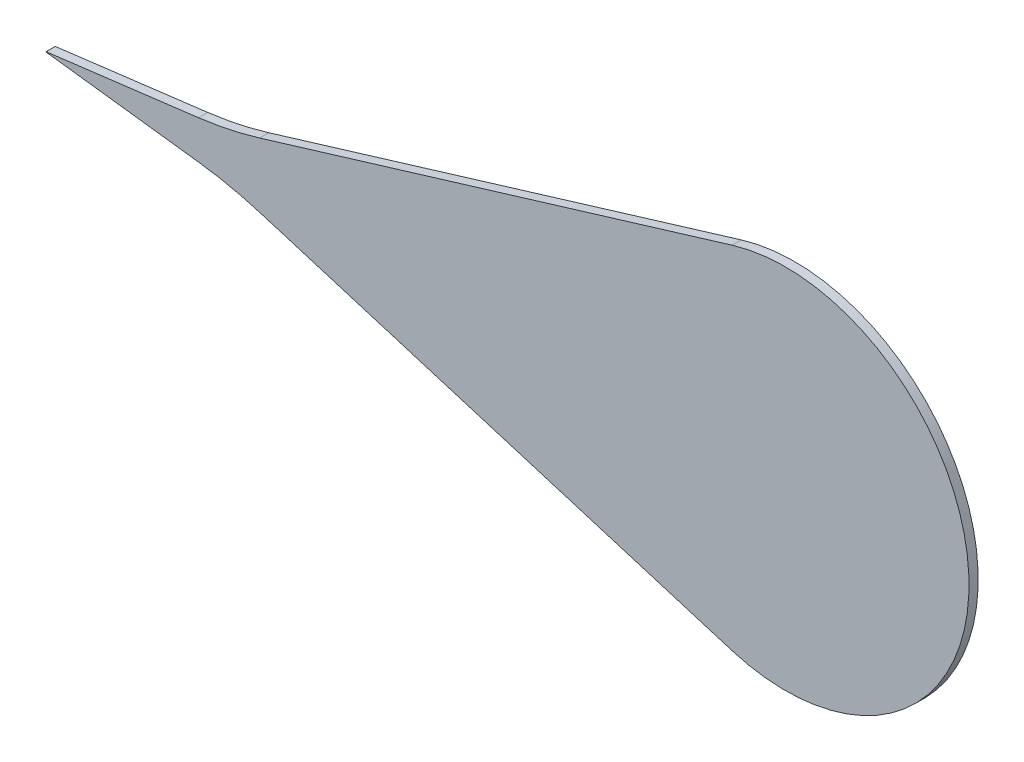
from build123d import *

# Parameters (mm, degrees)
EXTRUDE_2_DEPTH = 0.25


with BuildPart() as part:
    # Sketch 1 → Extrude 2 (new body)
    with BuildSketch(Plane.XY):
        with BuildLine():
            Line((0.357380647, 0.004961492), (4.50941379, 0.523267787))
            ThreePointArc((4.50941379, 0.523267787), (5.349803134, 0.664770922), (6.175092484, 0.877314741))
            Line((6.175092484, 0.877314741), (19.047808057, 4.784468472))
            ThreePointArc((19.047808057, 4.784468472), (25.5, 0), (19.047808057, -4.784468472))
            Line((19.047808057, -4.784468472), (6.175092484, -0.877314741))
            ThreePointArc((6.175092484, -0.877314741), (5.349803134, -0.664770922), (4.50941379, -0.523267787))
            Line((4.50941379, -0.523267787), (0.357380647, -0.004961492))
            ThreePointArc((0.357380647, -0.004961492), (0.353, 0), (0.357380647, 0.004961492))
        make_face()
    extrude(amount=EXTRUDE_2_DEPTH)


solid = part.part
